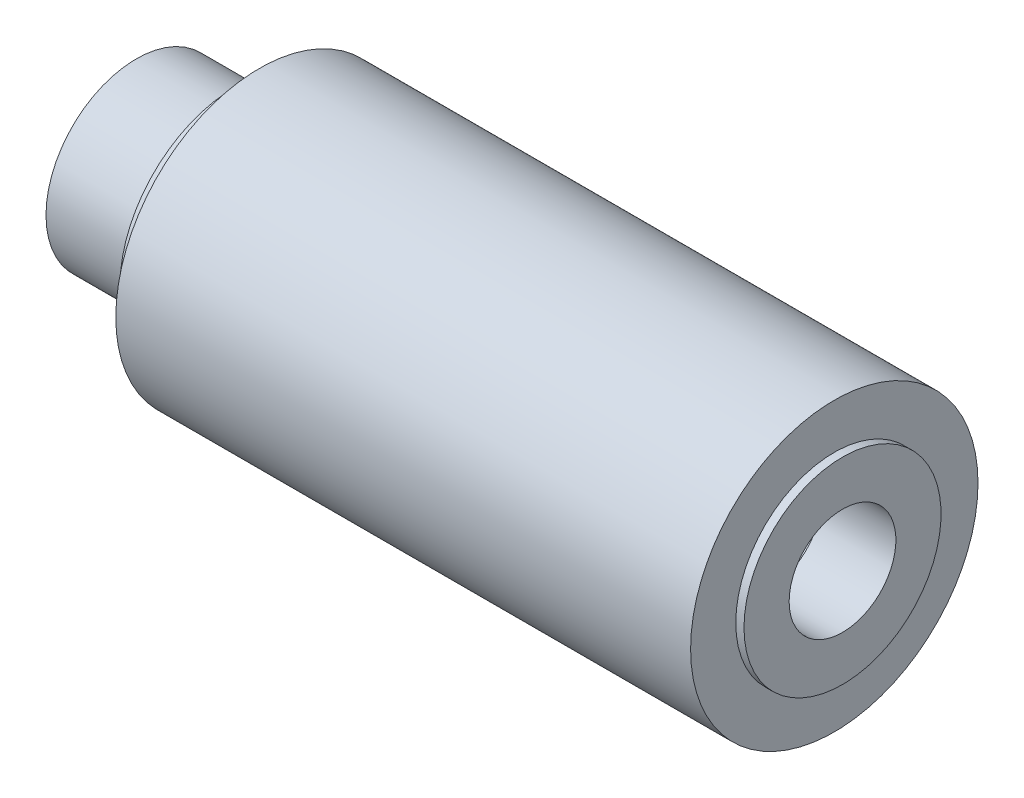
ISO-10303-21;
HEADER;
FILE_DESCRIPTION(('STEP AP214'),'2;1');
FILE_NAME('part.step','',(''),(''),'','','');
FILE_SCHEMA(('AUTOMOTIVE_DESIGN { 1 0 10303 214 1 1 1 1 }'));
ENDSEC;
DATA;
#1=APPLICATION_CONTEXT('core data for automotive mechanical design processes');
#2=APPLICATION_PROTOCOL_DEFINITION('international standard','automotive_design',2000,#1);
#3=PRODUCT_CONTEXT('',#1,'mechanical');
#4=PRODUCT('Part','Part','',(#3));
#5=PRODUCT_RELATED_PRODUCT_CATEGORY('part','',(#4));
#6=PRODUCT_DEFINITION_FORMATION('','',#4);
#7=PRODUCT_DEFINITION_CONTEXT('part definition',#1,'design');
#8=PRODUCT_DEFINITION('design','',#6,#7);
#9=PRODUCT_DEFINITION_SHAPE('','',#8);
#10=(LENGTH_UNIT() NAMED_UNIT(*) SI_UNIT(.MILLI.,.METRE.));
#11=(NAMED_UNIT(*) PLANE_ANGLE_UNIT() SI_UNIT($,.RADIAN.));
#12=(NAMED_UNIT(*) SI_UNIT($,.STERADIAN.) SOLID_ANGLE_UNIT());
#13=UNCERTAINTY_MEASURE_WITH_UNIT(LENGTH_MEASURE(1.E-05),#10,'distance_accuracy_value','');
#14=(GEOMETRIC_REPRESENTATION_CONTEXT(3) GLOBAL_UNCERTAINTY_ASSIGNED_CONTEXT((#13)) GLOBAL_UNIT_ASSIGNED_CONTEXT((#10,
#11,#12)) REPRESENTATION_CONTEXT('',''));
#15=CARTESIAN_POINT('',(0.,0.,0.));
#16=DIRECTION('',(0.,0.,1.));
#17=DIRECTION('',(1.,0.,0.));
#18=AXIS2_PLACEMENT_3D('',#15,#16,#17);
#19=CARTESIAN_POINT('',(-66.,-2.6547809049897,-16.761626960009));
#20=DIRECTION('',(1.,0.,0.));
#21=DIRECTION('',(0.,0.809016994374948,0.587785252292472));
#22=AXIS2_PLACEMENT_3D('',#19,#20,#21);
#23=PLANE('',#22);
#24=CARTESIAN_POINT('',(-66.,0.,0.));
#25=DIRECTION('',(-1.,0.,0.));
#26=DIRECTION('',(0.,0.,1.));
#27=AXIS2_PLACEMENT_3D('',#24,#25,#26);
#28=CIRCLE('',#27,12.);
#29=CARTESIAN_POINT('',(-66.,0.,12.));
#30=VERTEX_POINT('',#29);
#31=EDGE_CURVE('E75',#30,#30,#28,.T.);
#32=ORIENTED_EDGE('',*,*,#31,.F.);
#33=EDGE_LOOP('',(#32));
#34=FACE_BOUND('',#33,.T.);
#35=ADVANCED_FACE('F13',(#34),#23,.T.);
#36=CARTESIAN_POINT('',(-8.,0.,0.));
#37=DIRECTION('',(-1.,0.,0.));
#38=DIRECTION('',(0.,0.,1.));
#39=AXIS2_PLACEMENT_3D('',#36,#37,#38);
#40=CYLINDRICAL_SURFACE('',#39,12.);
#41=ORIENTED_EDGE('',*,*,#31,.T.);
#42=EDGE_LOOP('',(#41));
#43=FACE_BOUND('',#42,.T.);
#44=CARTESIAN_POINT('',(-8.,0.,0.));
#45=DIRECTION('',(-1.,0.,0.));
#46=DIRECTION('',(0.,0.,1.));
#47=AXIS2_PLACEMENT_3D('',#44,#45,#46);
#48=CIRCLE('',#47,12.);
#49=CARTESIAN_POINT('',(-8.,0.,12.));
#50=VERTEX_POINT('',#49);
#51=EDGE_CURVE('E70',#50,#50,#48,.T.);
#52=ORIENTED_EDGE('',*,*,#51,.F.);
#53=EDGE_LOOP('',(#52));
#54=FACE_BOUND('',#53,.T.);
#55=ADVANCED_FACE('F80',(#43,#54),#40,.F.);
#56=CARTESIAN_POINT('',(-85.,-15.364824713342,2.4335491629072));
#57=DIRECTION('',(-1.,0.,0.));
#58=DIRECTION('',(0.,0.809016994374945,0.587785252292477));
#59=AXIS2_PLACEMENT_3D('',#56,#57,#58);
#60=PLANE('',#59);
#61=CARTESIAN_POINT('',(-85.,0.,0.));
#62=DIRECTION('',(-1.,0.,0.));
#63=DIRECTION('',(0.,0.,1.));
#64=AXIS2_PLACEMENT_3D('',#61,#62,#63);
#65=CIRCLE('',#64,11.);
#66=CARTESIAN_POINT('',(-85.,0.,11.));
#67=VERTEX_POINT('',#66);
#68=EDGE_CURVE('E65',#67,#67,#65,.T.);
#69=ORIENTED_EDGE('',*,*,#68,.T.);
#70=EDGE_LOOP('',(#69));
#71=FACE_BOUND('',#70,.T.);
#72=ADVANCED_FACE('F89',(#71),#60,.T.);
#73=CARTESIAN_POINT('',(-8.,-16.761626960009,2.6547809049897));
#74=DIRECTION('',(-1.,0.,0.));
#75=DIRECTION('',(0.,0.809016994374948,0.587785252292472));
#76=AXIS2_PLACEMENT_3D('',#73,#74,#75);
#77=PLANE('',#76);
#78=CARTESIAN_POINT('',(-8.,0.,0.));
#79=DIRECTION('',(-1.,0.,0.));
#80=DIRECTION('',(0.,0.,1.));
#81=AXIS2_PLACEMENT_3D('',#78,#79,#80);
#82=CIRCLE('',#81,6.50000000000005);
#83=CARTESIAN_POINT('',(-8.,0.,6.50000000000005));
#84=VERTEX_POINT('',#83);
#85=EDGE_CURVE('E60',#84,#84,#82,.T.);
#86=ORIENTED_EDGE('',*,*,#85,.F.);
#87=EDGE_LOOP('',(#86));
#88=FACE_BOUND('',#87,.T.);
#89=ORIENTED_EDGE('',*,*,#51,.T.);
#90=EDGE_LOOP('',(#89));
#91=FACE_BOUND('',#90,.T.);
#92=ADVANCED_FACE('F119',(#88,#91),#77,.T.);
#93=CARTESIAN_POINT('',(-73.,0.,0.));
#94=DIRECTION('',(-1.,0.,0.));
#95=DIRECTION('',(0.,0.,1.));
#96=AXIS2_PLACEMENT_3D('',#93,#94,#95);
#97=CYLINDRICAL_SURFACE('',#96,11.);
#98=CARTESIAN_POINT('',(-73.,0.,0.));
#99=DIRECTION('',(-1.,0.,0.));
#100=DIRECTION('',(0.,0.,1.));
#101=AXIS2_PLACEMENT_3D('',#98,#99,#100);
#102=CIRCLE('',#101,11.);
#103=CARTESIAN_POINT('',(-73.,0.,11.));
#104=VERTEX_POINT('',#103);
#105=EDGE_CURVE('E55',#104,#104,#102,.F.);
#106=ORIENTED_EDGE('',*,*,#105,.F.);
#107=EDGE_LOOP('',(#106));
#108=FACE_BOUND('',#107,.T.);
#109=ORIENTED_EDGE('',*,*,#68,.F.);
#110=EDGE_LOOP('',(#109));
#111=FACE_BOUND('',#110,.T.);
#112=ADVANCED_FACE('F116',(#108,#111),#97,.T.);
#113=CARTESIAN_POINT('',(1.,0.,0.));
#114=DIRECTION('',(-1.,0.,0.));
#115=DIRECTION('',(0.,0.,1.));
#116=AXIS2_PLACEMENT_3D('',#113,#114,#115);
#117=CYLINDRICAL_SURFACE('',#116,6.50000000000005);
#118=ORIENTED_EDGE('',*,*,#85,.T.);
#119=EDGE_LOOP('',(#118));
#120=FACE_BOUND('',#119,.T.);
#121=CARTESIAN_POINT('',(1.,0.,0.));
#122=DIRECTION('',(-1.,0.,0.));
#123=DIRECTION('',(0.,0.,1.));
#124=AXIS2_PLACEMENT_3D('',#121,#122,#123);
#125=CIRCLE('',#124,6.50000000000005);
#126=CARTESIAN_POINT('',(1.,0.,6.50000000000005));
#127=VERTEX_POINT('',#126);
#128=EDGE_CURVE('E50',#127,#127,#125,.T.);
#129=ORIENTED_EDGE('',*,*,#128,.F.);
#130=EDGE_LOOP('',(#129));
#131=FACE_BOUND('',#130,.T.);
#132=ADVANCED_FACE('F112',(#120,#131),#117,.F.);
#133=CARTESIAN_POINT('',(-73.,-19.555231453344,3.0972443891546));
#134=DIRECTION('',(-1.,0.,0.));
#135=DIRECTION('',(0.,0.809016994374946,0.587785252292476));
#136=AXIS2_PLACEMENT_3D('',#133,#134,#135);
#137=PLANE('',#136);
#138=ORIENTED_EDGE('',*,*,#105,.T.);
#139=EDGE_LOOP('',(#138));
#140=FACE_BOUND('',#139,.T.);
#141=CARTESIAN_POINT('',(-73.,0.,0.));
#142=DIRECTION('',(-1.,0.,0.));
#143=DIRECTION('',(0.,0.,1.));
#144=AXIS2_PLACEMENT_3D('',#141,#142,#143);
#145=CIRCLE('',#144,13.9999999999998);
#146=CARTESIAN_POINT('',(-73.,0.,13.9999999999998));
#147=VERTEX_POINT('',#146);
#148=EDGE_CURVE('E45',#147,#147,#145,.T.);
#149=ORIENTED_EDGE('',*,*,#148,.T.);
#150=EDGE_LOOP('',(#149));
#151=FACE_BOUND('',#150,.T.);
#152=ADVANCED_FACE('F115',(#140,#151),#137,.T.);
#153=CARTESIAN_POINT('',(1.,-2.6547809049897,-16.761626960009));
#154=DIRECTION('',(1.,0.,0.));
#155=DIRECTION('',(0.,0.809016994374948,0.587785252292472));
#156=AXIS2_PLACEMENT_3D('',#153,#154,#155);
#157=PLANE('',#156);
#158=ORIENTED_EDGE('',*,*,#128,.T.);
#159=EDGE_LOOP('',(#158));
#160=FACE_BOUND('',#159,.T.);
#161=CARTESIAN_POINT('',(1.,0.,0.));
#162=DIRECTION('',(-1.,0.,0.));
#163=DIRECTION('',(0.,0.,1.));
#164=AXIS2_PLACEMENT_3D('',#161,#162,#163);
#165=CIRCLE('',#164,12.);
#166=CARTESIAN_POINT('',(1.,0.,12.));
#167=VERTEX_POINT('',#166);
#168=EDGE_CURVE('E40',#167,#167,#165,.F.);
#169=ORIENTED_EDGE('',*,*,#168,.T.);
#170=EDGE_LOOP('',(#169));
#171=FACE_BOUND('',#170,.T.);
#172=ADVANCED_FACE('F110',(#160,#171),#157,.T.);
#173=CARTESIAN_POINT('',(-70.,0.,0.));
#174=DIRECTION('',(-1.,0.,0.));
#175=DIRECTION('',(0.,0.,1.));
#176=AXIS2_PLACEMENT_3D('',#173,#174,#175);
#177=CYLINDRICAL_SURFACE('',#176,13.9999999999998);
#178=CARTESIAN_POINT('',(-70.,0.,0.));
#179=DIRECTION('',(-1.,0.,0.));
#180=DIRECTION('',(0.,0.,1.));
#181=AXIS2_PLACEMENT_3D('',#178,#179,#180);
#182=CIRCLE('',#181,13.9999999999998);
#183=CARTESIAN_POINT('',(-70.,0.,13.9999999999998));
#184=VERTEX_POINT('',#183);
#185=EDGE_CURVE('E35',#184,#184,#182,.F.);
#186=ORIENTED_EDGE('',*,*,#185,.F.);
#187=EDGE_LOOP('',(#186));
#188=FACE_BOUND('',#187,.T.);
#189=ORIENTED_EDGE('',*,*,#148,.F.);
#190=EDGE_LOOP('',(#189));
#191=FACE_BOUND('',#190,.T.);
#192=ADVANCED_FACE('F106',(#188,#191),#177,.T.);
#193=CARTESIAN_POINT('',(1.,0.,0.));
#194=DIRECTION('',(-1.,0.,0.));
#195=DIRECTION('',(0.,0.,1.));
#196=AXIS2_PLACEMENT_3D('',#193,#194,#195);
#197=CYLINDRICAL_SURFACE('',#196,12.);
#198=ORIENTED_EDGE('',*,*,#168,.F.);
#199=EDGE_LOOP('',(#198));
#200=FACE_BOUND('',#199,.T.);
#201=CARTESIAN_POINT('',(0.,0.,0.));
#202=DIRECTION('',(-1.,0.,0.));
#203=DIRECTION('',(0.,0.,1.));
#204=AXIS2_PLACEMENT_3D('',#201,#202,#203);
#205=CIRCLE('',#204,12.);
#206=CARTESIAN_POINT('',(0.,0.,12.));
#207=VERTEX_POINT('',#206);
#208=EDGE_CURVE('E26',#207,#207,#205,.T.);
#209=ORIENTED_EDGE('',*,*,#208,.F.);
#210=EDGE_LOOP('',(#209));
#211=FACE_BOUND('',#210,.T.);
#212=ADVANCED_FACE('F103',(#200,#211),#197,.T.);
#213=CARTESIAN_POINT('',(-70.,-24.44403931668,3.8715554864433));
#214=DIRECTION('',(-1.,0.,0.));
#215=DIRECTION('',(0.,0.809016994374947,0.587785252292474));
#216=AXIS2_PLACEMENT_3D('',#213,#214,#215);
#217=PLANE('',#216);
#218=ORIENTED_EDGE('',*,*,#185,.T.);
#219=EDGE_LOOP('',(#218));
#220=FACE_BOUND('',#219,.T.);
#221=CARTESIAN_POINT('',(-70.,0.,0.));
#222=DIRECTION('',(-1.,0.,0.));
#223=DIRECTION('',(0.,0.,1.));
#224=AXIS2_PLACEMENT_3D('',#221,#222,#223);
#225=CIRCLE('',#224,17.5000000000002);
#226=CARTESIAN_POINT('',(-70.,0.,17.5000000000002));
#227=VERTEX_POINT('',#226);
#228=EDGE_CURVE('E21',#227,#227,#225,.T.);
#229=ORIENTED_EDGE('',*,*,#228,.T.);
#230=EDGE_LOOP('',(#229));
#231=FACE_BOUND('',#230,.T.);
#232=ADVANCED_FACE('F99',(#220,#231),#217,.T.);
#233=CARTESIAN_POINT('',(0.,-3.8715554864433,-24.44403931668));
#234=DIRECTION('',(1.,0.,0.));
#235=DIRECTION('',(0.,0.809016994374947,0.587785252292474));
#236=AXIS2_PLACEMENT_3D('',#233,#234,#235);
#237=PLANE('',#236);
#238=ORIENTED_EDGE('',*,*,#208,.T.);
#239=EDGE_LOOP('',(#238));
#240=FACE_BOUND('',#239,.T.);
#241=CARTESIAN_POINT('',(0.,0.,0.));
#242=DIRECTION('',(-1.,0.,0.));
#243=DIRECTION('',(0.,0.,1.));
#244=AXIS2_PLACEMENT_3D('',#241,#242,#243);
#245=CIRCLE('',#244,17.5000000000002);
#246=CARTESIAN_POINT('',(0.,0.,17.5000000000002));
#247=VERTEX_POINT('',#246);
#248=EDGE_CURVE('E9',#247,#247,#245,.F.);
#249=ORIENTED_EDGE('',*,*,#248,.T.);
#250=EDGE_LOOP('',(#249));
#251=FACE_BOUND('',#250,.T.);
#252=ADVANCED_FACE('F15',(#240,#251),#237,.T.);
#253=CARTESIAN_POINT('',(0.,0.,0.));
#254=DIRECTION('',(-1.,0.,0.));
#255=DIRECTION('',(0.,0.,1.));
#256=AXIS2_PLACEMENT_3D('',#253,#254,#255);
#257=CYLINDRICAL_SURFACE('',#256,17.5000000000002);
#258=ORIENTED_EDGE('',*,*,#248,.F.);
#259=EDGE_LOOP('',(#258));
#260=FACE_BOUND('',#259,.T.);
#261=ORIENTED_EDGE('',*,*,#228,.F.);
#262=EDGE_LOOP('',(#261));
#263=FACE_BOUND('',#262,.T.);
#264=ADVANCED_FACE('F93',(#260,#263),#257,.T.);
#265=CLOSED_SHELL('',(#35,#55,#72,#92,#112,#132,#152,#172,#192,#212,#232,#252,#264));
#266=MANIFOLD_SOLID_BREP('B1',#265);
#267=ADVANCED_BREP_SHAPE_REPRESENTATION('',(#18,#266),#14);
#268=SHAPE_DEFINITION_REPRESENTATION(#9,#267);
ENDSEC;
END-ISO-10303-21;
